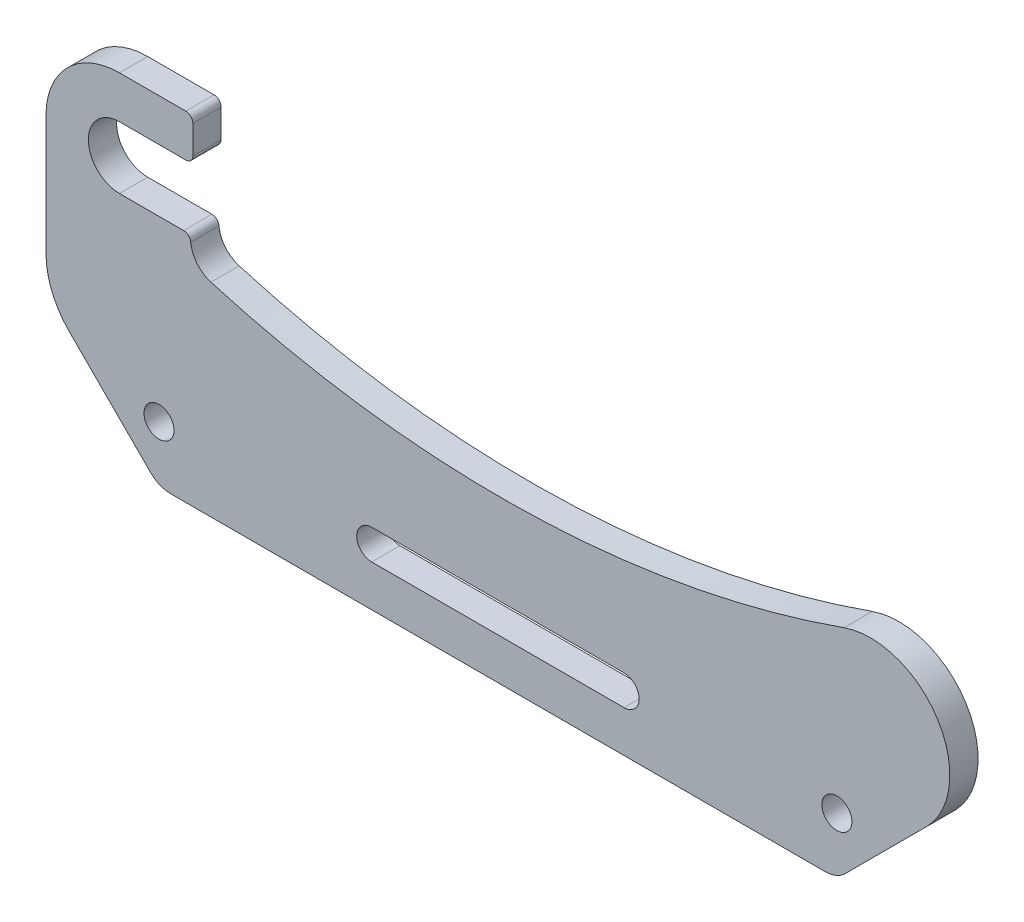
ISO-10303-21;
HEADER;
FILE_DESCRIPTION(('STEP AP214'),'2;1');
FILE_NAME('part.step','',(''),(''),'','','');
FILE_SCHEMA(('AUTOMOTIVE_DESIGN { 1 0 10303 214 1 1 1 1 }'));
ENDSEC;
DATA;
#1=APPLICATION_CONTEXT('core data for automotive mechanical design processes');
#2=APPLICATION_PROTOCOL_DEFINITION('international standard','automotive_design',2000,#1);
#3=PRODUCT_CONTEXT('',#1,'mechanical');
#4=PRODUCT('Part','Part','',(#3));
#5=PRODUCT_RELATED_PRODUCT_CATEGORY('part','',(#4));
#6=PRODUCT_DEFINITION_FORMATION('','',#4);
#7=PRODUCT_DEFINITION_CONTEXT('part definition',#1,'design');
#8=PRODUCT_DEFINITION('design','',#6,#7);
#9=PRODUCT_DEFINITION_SHAPE('','',#8);
#10=(LENGTH_UNIT() NAMED_UNIT(*) SI_UNIT(.MILLI.,.METRE.));
#11=(NAMED_UNIT(*) PLANE_ANGLE_UNIT() SI_UNIT($,.RADIAN.));
#12=(NAMED_UNIT(*) SI_UNIT($,.STERADIAN.) SOLID_ANGLE_UNIT());
#13=UNCERTAINTY_MEASURE_WITH_UNIT(LENGTH_MEASURE(1.E-05),#10,'distance_accuracy_value','');
#14=(GEOMETRIC_REPRESENTATION_CONTEXT(3) GLOBAL_UNCERTAINTY_ASSIGNED_CONTEXT((#13)) GLOBAL_UNIT_ASSIGNED_CONTEXT((#10,
#11,#12)) REPRESENTATION_CONTEXT('',''));
#15=CARTESIAN_POINT('',(0.,0.,0.));
#16=DIRECTION('',(0.,0.,1.));
#17=DIRECTION('',(1.,0.,0.));
#18=AXIS2_PLACEMENT_3D('',#15,#16,#17);
#19=CARTESIAN_POINT('',(161.29,-59.69,0.));
#20=DIRECTION('',(-0.707106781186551,0.707106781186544,0.));
#21=DIRECTION('',(-0.707106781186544,-0.707106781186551,0.));
#22=AXIS2_PLACEMENT_3D('',#19,#20,#21);
#23=PLANE('',#22);
#24=DIRECTION('',(-0.707106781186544,-0.707106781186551,0.));
#25=VECTOR('',#24,1.);
#26=CARTESIAN_POINT('',(161.29,-59.69,6.35));
#27=LINE('',#26,#25);
#28=CARTESIAN_POINT('',(181.464198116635,-39.5158018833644,6.35));
#29=VERTEX_POINT('',#28);
#30=CARTESIAN_POINT('',(163.149871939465,-57.8301280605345,6.35));
#31=VERTEX_POINT('',#30);
#32=EDGE_CURVE('E312',#29,#31,#27,.T.);
#33=ORIENTED_EDGE('',*,*,#32,.T.);
#34=DIRECTION('',(0.,0.,1.));
#35=VECTOR('',#34,1.);
#36=CARTESIAN_POINT('',(163.149871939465,-57.8301280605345,0.));
#37=LINE('',#36,#35);
#38=CARTESIAN_POINT('',(163.149871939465,-57.8301280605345,0.));
#39=VERTEX_POINT('',#38);
#40=EDGE_CURVE('E415',#31,#39,#37,.F.);
#41=ORIENTED_EDGE('',*,*,#40,.T.);
#42=DIRECTION('',(-0.707106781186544,-0.707106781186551,0.));
#43=VECTOR('',#42,1.);
#44=CARTESIAN_POINT('',(161.29,-59.69,0.));
#45=LINE('',#44,#43);
#46=CARTESIAN_POINT('',(181.464198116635,-39.5158018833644,0.));
#47=VERTEX_POINT('',#46);
#48=EDGE_CURVE('E315',#47,#39,#45,.T.);
#49=ORIENTED_EDGE('',*,*,#48,.F.);
#50=DIRECTION('',(0.,0.,1.));
#51=VECTOR('',#50,1.);
#52=CARTESIAN_POINT('',(181.464198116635,-39.5158018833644,0.));
#53=LINE('',#52,#51);
#54=EDGE_CURVE('E309',#47,#29,#53,.T.);
#55=ORIENTED_EDGE('',*,*,#54,.T.);
#56=EDGE_LOOP('',(#33,#41,#49,#55));
#57=FACE_BOUND('',#56,.T.);
#58=ADVANCED_FACE('F110',(#57),#23,.F.);
#59=CARTESIAN_POINT('',(0.,-6.985,6.35));
#60=DIRECTION('',(0.,-1.,0.));
#61=DIRECTION('',(1.,0.,0.));
#62=AXIS2_PLACEMENT_3D('',#59,#60,#61);
#63=PLANE('',#62);
#64=DIRECTION('',(-1.,0.,0.));
#65=VECTOR('',#64,1.);
#66=CARTESIAN_POINT('',(186.69,-6.985,6.35));
#67=LINE('',#66,#65);
#68=CARTESIAN_POINT('',(14.4456506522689,-6.985,6.35));
#69=VERTEX_POINT('',#68);
#70=CARTESIAN_POINT('',(0.,-6.985,6.35));
#71=VERTEX_POINT('',#70);
#72=EDGE_CURVE('E360',#69,#71,#67,.T.);
#73=ORIENTED_EDGE('',*,*,#72,.F.);
#74=DIRECTION('',(0.,0.,1.));
#75=VECTOR('',#74,1.);
#76=CARTESIAN_POINT('',(14.4456506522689,-6.985,6.35));
#77=LINE('',#76,#75);
#78=CARTESIAN_POINT('',(14.4456506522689,-6.985,0.));
#79=VERTEX_POINT('',#78);
#80=EDGE_CURVE('E118',#69,#79,#77,.F.);
#81=ORIENTED_EDGE('',*,*,#80,.T.);
#82=DIRECTION('',(-1.,0.,0.));
#83=VECTOR('',#82,1.);
#84=CARTESIAN_POINT('',(0.,-6.985,0.));
#85=LINE('',#84,#83);
#86=CARTESIAN_POINT('',(0.,-6.985,0.));
#87=VERTEX_POINT('',#86);
#88=EDGE_CURVE('E345',#79,#87,#85,.T.);
#89=ORIENTED_EDGE('',*,*,#88,.T.);
#90=DIRECTION('',(0.,0.,-1.));
#91=VECTOR('',#90,1.);
#92=CARTESIAN_POINT('',(0.,-6.985,6.35));
#93=LINE('',#92,#91);
#94=EDGE_CURVE('E362',#71,#87,#93,.T.);
#95=ORIENTED_EDGE('',*,*,#94,.F.);
#96=EDGE_LOOP('',(#73,#81,#89,#95));
#97=FACE_BOUND('',#96,.T.);
#98=ADVANCED_FACE('F452',(#97),#63,.F.);
#99=CARTESIAN_POINT('',(0.,0.,6.35));
#100=DIRECTION('',(0.,0.,1.));
#101=DIRECTION('',(1.,0.,0.));
#102=AXIS2_PLACEMENT_3D('',#99,#100,#101);
#103=PLANE('',#102);
#104=CARTESIAN_POINT('',(113.4618,-46.99,6.35));
#105=DIRECTION('',(0.,0.,1.));
#106=DIRECTION('',(1.,0.,0.));
#107=AXIS2_PLACEMENT_3D('',#104,#105,#106);
#108=CIRCLE('',#107,3.37819999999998);
#109=CARTESIAN_POINT('',(113.4618,-50.3682,6.35));
#110=VERTEX_POINT('',#109);
#111=CARTESIAN_POINT('',(113.4618,-43.6118,6.35));
#112=VERTEX_POINT('',#111);
#113=EDGE_CURVE('E295',#110,#112,#108,.T.);
#114=ORIENTED_EDGE('',*,*,#113,.F.);
#115=DIRECTION('',(1.,0.,0.));
#116=VECTOR('',#115,1.);
#117=CARTESIAN_POINT('',(56.7182,-50.3682,6.35));
#118=LINE('',#117,#116);
#119=CARTESIAN_POINT('',(56.7182,-50.3682,6.35));
#120=VERTEX_POINT('',#119);
#121=EDGE_CURVE('E275',#120,#110,#118,.T.);
#122=ORIENTED_EDGE('',*,*,#121,.F.);
#123=CARTESIAN_POINT('',(56.7182,-46.99,6.35));
#124=DIRECTION('',(0.,0.,1.));
#125=DIRECTION('',(1.,0.,0.));
#126=AXIS2_PLACEMENT_3D('',#123,#124,#125);
#127=CIRCLE('',#126,3.37819999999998);
#128=CARTESIAN_POINT('',(56.7182,-43.6118,6.35));
#129=VERTEX_POINT('',#128);
#130=EDGE_CURVE('E282',#129,#120,#127,.T.);
#131=ORIENTED_EDGE('',*,*,#130,.F.);
#132=DIRECTION('',(1.,0.,0.));
#133=VECTOR('',#132,1.);
#134=CARTESIAN_POINT('',(56.7182,-43.6118,6.35));
#135=LINE('',#134,#133);
#136=EDGE_CURVE('E290',#129,#112,#135,.T.);
#137=ORIENTED_EDGE('',*,*,#136,.T.);
#138=EDGE_LOOP('',(#114,#122,#131,#137));
#139=FACE_BOUND('',#138,.T.);
#140=DIRECTION('',(0.,1.,0.));
#141=VECTOR('',#140,1.);
#142=CARTESIAN_POINT('',(16.51,6.985,6.35));
#143=LINE('',#142,#141);
#144=CARTESIAN_POINT('',(16.51,8.5725,6.35));
#145=VERTEX_POINT('',#144);
#146=CARTESIAN_POINT('',(16.51,14.9225,6.35));
#147=VERTEX_POINT('',#146);
#148=EDGE_CURVE('E347',#145,#147,#143,.T.);
#149=ORIENTED_EDGE('',*,*,#148,.T.);
#150=CARTESIAN_POINT('',(14.9225,14.9225,6.35));
#151=DIRECTION('',(0.,0.,1.));
#152=DIRECTION('',(1.,0.,0.));
#153=AXIS2_PLACEMENT_3D('',#150,#151,#152);
#154=CIRCLE('',#153,1.5875);
#155=CARTESIAN_POINT('',(14.9225,16.51,6.35));
#156=VERTEX_POINT('',#155);
#157=EDGE_CURVE('E445',#147,#156,#154,.T.);
#158=ORIENTED_EDGE('',*,*,#157,.T.);
#159=DIRECTION('',(-1.,0.,0.));
#160=VECTOR('',#159,1.);
#161=CARTESIAN_POINT('',(16.51,16.51,6.35));
#162=LINE('',#161,#160);
#163=CARTESIAN_POINT('',(0.,16.51,6.35));
#164=VERTEX_POINT('',#163);
#165=EDGE_CURVE('E350',#156,#164,#162,.T.);
#166=ORIENTED_EDGE('',*,*,#165,.T.);
#167=CARTESIAN_POINT('',(0.,0.,6.35));
#168=DIRECTION('',(0.,0.,1.));
#169=DIRECTION('',(1.,0.,0.));
#170=AXIS2_PLACEMENT_3D('',#167,#168,#169);
#171=CIRCLE('',#170,16.51);
#172=CARTESIAN_POINT('',(-16.51,-1.152887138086E-13,6.35));
#173=VERTEX_POINT('',#172);
#174=EDGE_CURVE('E352',#164,#173,#171,.T.);
#175=ORIENTED_EDGE('',*,*,#174,.T.);
#176=DIRECTION('',(0.,-1.,0.));
#177=VECTOR('',#176,1.);
#178=CARTESIAN_POINT('',(-16.51,-1.152887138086E-13,6.35));
#179=LINE('',#178,#177);
#180=CARTESIAN_POINT('',(-16.51,-26.8996000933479,6.35));
#181=VERTEX_POINT('',#180);
#182=EDGE_CURVE('E354',#173,#181,#179,.T.);
#183=ORIENTED_EDGE('',*,*,#182,.T.);
#184=CARTESIAN_POINT('',(1.332003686,-26.8996000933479,6.35));
#185=DIRECTION('',(0.,0.,1.));
#186=DIRECTION('',(1.,0.,0.));
#187=AXIS2_PLACEMENT_3D('',#184,#185,#186);
#188=CIRCLE('',#187,17.842003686);
#189=CARTESIAN_POINT('',(-11.284198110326,-39.5158018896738,6.35));
#190=VERTEX_POINT('',#189);
#191=EDGE_CURVE('E395',#181,#190,#188,.T.);
#192=ORIENTED_EDGE('',*,*,#191,.T.);
#193=DIRECTION('',(-0.707106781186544,0.707106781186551,0.));
#194=VECTOR('',#193,1.);
#195=CARTESIAN_POINT('',(8.89,-59.69,6.35));
#196=LINE('',#195,#194);
#197=CARTESIAN_POINT('',(7.03012806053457,-57.8301280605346,6.35));
#198=VERTEX_POINT('',#197);
#199=EDGE_CURVE('E318',#198,#190,#196,.T.);
#200=ORIENTED_EDGE('',*,*,#199,.F.);
#201=CARTESIAN_POINT('',(11.5202561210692,-53.34,6.35));
#202=DIRECTION('',(0.,0.,1.));
#203=DIRECTION('',(1.,0.,0.));
#204=AXIS2_PLACEMENT_3D('',#201,#202,#203);
#205=CIRCLE('',#204,6.35);
#206=CARTESIAN_POINT('',(11.5202561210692,-59.69,6.35));
#207=VERTEX_POINT('',#206);
#208=EDGE_CURVE('E411',#198,#207,#205,.T.);
#209=ORIENTED_EDGE('',*,*,#208,.T.);
#210=DIRECTION('',(1.,0.,0.));
#211=VECTOR('',#210,1.);
#212=CARTESIAN_POINT('',(-16.51,-59.69,6.35));
#213=LINE('',#212,#211);
#214=CARTESIAN_POINT('',(158.659743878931,-59.69,6.35));
#215=VERTEX_POINT('',#214);
#216=EDGE_CURVE('E357',#207,#215,#213,.T.);
#217=ORIENTED_EDGE('',*,*,#216,.T.);
#218=CARTESIAN_POINT('',(158.659743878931,-53.34,6.35));
#219=DIRECTION('',(0.,0.,1.));
#220=DIRECTION('',(1.,0.,0.));
#221=AXIS2_PLACEMENT_3D('',#218,#219,#220);
#222=CIRCLE('',#221,6.35);
#223=EDGE_CURVE('E413',#215,#31,#222,.T.);
#224=ORIENTED_EDGE('',*,*,#223,.T.);
#225=ORIENTED_EDGE('',*,*,#32,.F.);
#226=CARTESIAN_POINT('',(168.847996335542,-26.8996001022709,6.35));
#227=DIRECTION('',(0.,0.,-1.));
#228=DIRECTION('',(1.,0.,0.));
#229=AXIS2_PLACEMENT_3D('',#226,#227,#228);
#230=CIRCLE('',#229,17.8420036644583);
#231=CARTESIAN_POINT('',(162.897569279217,-10.0790914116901,6.35));
#232=VERTEX_POINT('',#231);
#233=EDGE_CURVE('E303',#232,#29,#230,.T.);
#234=ORIENTED_EDGE('',*,*,#233,.F.);
#235=CARTESIAN_POINT('',(85.725,208.07027164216,6.35));
#236=DIRECTION('',(0.,0.,1.));
#237=DIRECTION('',(1.,0.,0.));
#238=AXIS2_PLACEMENT_3D('',#235,#236,#237);
#239=CIRCLE('',#238,231.397385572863);
#240=CARTESIAN_POINT('',(20.563849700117,-13.9630018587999,6.35));
#241=VERTEX_POINT('',#240);
#242=EDGE_CURVE('E336',#241,#232,#239,.T.);
#243=ORIENTED_EDGE('',*,*,#242,.F.);
#244=CARTESIAN_POINT('',(22.352,-7.86997153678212,6.35));
#245=DIRECTION('',(0.,0.,1.));
#246=DIRECTION('',(1.,0.,0.));
#247=AXIS2_PLACEMENT_3D('',#244,#245,#246);
#248=CIRCLE('',#247,6.35);
#249=CARTESIAN_POINT('',(16.0269205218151,-8.43199430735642,6.35));
#250=VERTEX_POINT('',#249);
#251=EDGE_CURVE('E424',#241,#250,#248,.F.);
#252=ORIENTED_EDGE('',*,*,#251,.T.);
#253=CARTESIAN_POINT('',(14.4456506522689,-8.5725,6.35));
#254=DIRECTION('',(0.,0.,1.));
#255=DIRECTION('',(1.,0.,0.));
#256=AXIS2_PLACEMENT_3D('',#253,#254,#255);
#257=CIRCLE('',#256,1.5875);
#258=EDGE_CURVE('E131',#250,#69,#257,.T.);
#259=ORIENTED_EDGE('',*,*,#258,.T.);
#260=ORIENTED_EDGE('',*,*,#72,.T.);
#261=CARTESIAN_POINT('',(0.,0.,6.35));
#262=DIRECTION('',(0.,0.,-1.));
#263=DIRECTION('',(1.,0.,0.));
#264=AXIS2_PLACEMENT_3D('',#261,#262,#263);
#265=CIRCLE('',#264,6.985);
#266=CARTESIAN_POINT('',(0.,6.985,6.35));
#267=VERTEX_POINT('',#266);
#268=EDGE_CURVE('E341',#71,#267,#265,.T.);
#269=ORIENTED_EDGE('',*,*,#268,.T.);
#270=DIRECTION('',(1.,0.,0.));
#271=VECTOR('',#270,1.);
#272=CARTESIAN_POINT('',(0.,6.985,6.35));
#273=LINE('',#272,#271);
#274=CARTESIAN_POINT('',(14.9225,6.985,6.35));
#275=VERTEX_POINT('',#274);
#276=EDGE_CURVE('E344',#267,#275,#273,.T.);
#277=ORIENTED_EDGE('',*,*,#276,.T.);
#278=CARTESIAN_POINT('',(14.9225,8.5725,6.35));
#279=DIRECTION('',(0.,0.,1.));
#280=DIRECTION('',(1.,0.,0.));
#281=AXIS2_PLACEMENT_3D('',#278,#279,#280);
#282=CIRCLE('',#281,1.5875);
#283=EDGE_CURVE('E442',#275,#145,#282,.T.);
#284=ORIENTED_EDGE('',*,*,#283,.T.);
#285=EDGE_LOOP('',(#149,#158,#166,#175,#183,#192,#200,#209,#217,#224,#225,#234,#243,#252,#259,
#260,#269,#277,#284));
#286=FACE_BOUND('',#285,.T.);
#287=CARTESIAN_POINT('',(8.89,-46.99,6.35));
#288=DIRECTION('',(0.,0.,1.));
#289=DIRECTION('',(1.,0.,0.));
#290=AXIS2_PLACEMENT_3D('',#287,#288,#289);
#291=CIRCLE('',#290,3.3782);
#292=CARTESIAN_POINT('',(12.2682,-46.99,6.35));
#293=VERTEX_POINT('',#292);
#294=EDGE_CURVE('E323',#293,#293,#291,.T.);
#295=ORIENTED_EDGE('',*,*,#294,.F.);
#296=EDGE_LOOP('',(#295));
#297=FACE_BOUND('',#296,.T.);
#298=CARTESIAN_POINT('',(161.29,-46.99,6.35));
#299=DIRECTION('',(0.,0.,1.));
#300=DIRECTION('',(1.,0.,0.));
#301=AXIS2_PLACEMENT_3D('',#298,#299,#300);
#302=CIRCLE('',#301,3.3782);
#303=CARTESIAN_POINT('',(164.6682,-46.99,6.35));
#304=VERTEX_POINT('',#303);
#305=EDGE_CURVE('E330',#304,#304,#302,.T.);
#306=ORIENTED_EDGE('',*,*,#305,.F.);
#307=EDGE_LOOP('',(#306));
#308=FACE_BOUND('',#307,.T.);
#309=ADVANCED_FACE('F466',(#139,#286,#297,#308),#103,.T.);
#310=CARTESIAN_POINT('',(0.,0.,0.));
#311=DIRECTION('',(0.,0.,1.));
#312=DIRECTION('',(1.,0.,0.));
#313=AXIS2_PLACEMENT_3D('',#310,#311,#312);
#314=PLANE('',#313);
#315=DIRECTION('',(1.,0.,0.));
#316=VECTOR('',#315,1.);
#317=CARTESIAN_POINT('',(56.7182,-50.3682,0.));
#318=LINE('',#317,#316);
#319=CARTESIAN_POINT('',(56.7182,-50.3682,0.));
#320=VERTEX_POINT('',#319);
#321=CARTESIAN_POINT('',(113.4618,-50.3682,0.));
#322=VERTEX_POINT('',#321);
#323=EDGE_CURVE('E264',#320,#322,#318,.T.);
#324=ORIENTED_EDGE('',*,*,#323,.T.);
#325=CARTESIAN_POINT('',(113.4618,-46.99,0.));
#326=DIRECTION('',(0.,0.,1.));
#327=DIRECTION('',(1.,0.,0.));
#328=AXIS2_PLACEMENT_3D('',#325,#326,#327);
#329=CIRCLE('',#328,3.3782);
#330=CARTESIAN_POINT('',(113.4618,-43.6118,0.));
#331=VERTEX_POINT('',#330);
#332=EDGE_CURVE('E298',#322,#331,#329,.T.);
#333=ORIENTED_EDGE('',*,*,#332,.T.);
#334=DIRECTION('',(1.,0.,0.));
#335=VECTOR('',#334,1.);
#336=CARTESIAN_POINT('',(56.7182,-43.6118,0.));
#337=LINE('',#336,#335);
#338=CARTESIAN_POINT('',(56.7182,-43.6118,0.));
#339=VERTEX_POINT('',#338);
#340=EDGE_CURVE('E274',#339,#331,#337,.T.);
#341=ORIENTED_EDGE('',*,*,#340,.F.);
#342=CARTESIAN_POINT('',(56.7182,-46.99,0.));
#343=DIRECTION('',(0.,0.,1.));
#344=DIRECTION('',(1.,0.,0.));
#345=AXIS2_PLACEMENT_3D('',#342,#343,#344);
#346=CIRCLE('',#345,3.3782);
#347=EDGE_CURVE('E279',#339,#320,#346,.T.);
#348=ORIENTED_EDGE('',*,*,#347,.T.);
#349=EDGE_LOOP('',(#324,#333,#341,#348));
#350=FACE_BOUND('',#349,.T.);
#351=CARTESIAN_POINT('',(8.89,-46.99,0.));
#352=DIRECTION('',(0.,0.,1.));
#353=DIRECTION('',(1.,0.,0.));
#354=AXIS2_PLACEMENT_3D('',#351,#352,#353);
#355=CIRCLE('',#354,3.3782);
#356=CARTESIAN_POINT('',(12.2682,-46.99,0.));
#357=VERTEX_POINT('',#356);
#358=EDGE_CURVE('E327',#357,#357,#355,.T.);
#359=ORIENTED_EDGE('',*,*,#358,.T.);
#360=EDGE_LOOP('',(#359));
#361=FACE_BOUND('',#360,.T.);
#362=CARTESIAN_POINT('',(161.29,-46.99,0.));
#363=DIRECTION('',(0.,0.,1.));
#364=DIRECTION('',(1.,0.,0.));
#365=AXIS2_PLACEMENT_3D('',#362,#363,#364);
#366=CIRCLE('',#365,3.3782);
#367=CARTESIAN_POINT('',(164.6682,-46.99,0.));
#368=VERTEX_POINT('',#367);
#369=EDGE_CURVE('E333',#368,#368,#366,.T.);
#370=ORIENTED_EDGE('',*,*,#369,.T.);
#371=EDGE_LOOP('',(#370));
#372=FACE_BOUND('',#371,.T.);
#373=DIRECTION('',(-1.,0.,0.));
#374=VECTOR('',#373,1.);
#375=CARTESIAN_POINT('',(16.51,16.51,0.));
#376=LINE('',#375,#374);
#377=CARTESIAN_POINT('',(14.9225,16.51,0.));
#378=VERTEX_POINT('',#377);
#379=CARTESIAN_POINT('',(0.,16.51,0.));
#380=VERTEX_POINT('',#379);
#381=EDGE_CURVE('E370',#378,#380,#376,.T.);
#382=ORIENTED_EDGE('',*,*,#381,.F.);
#383=CARTESIAN_POINT('',(14.9225,14.9225,0.));
#384=DIRECTION('',(0.,0.,1.));
#385=DIRECTION('',(1.,0.,0.));
#386=AXIS2_PLACEMENT_3D('',#383,#384,#385);
#387=CIRCLE('',#386,1.5875);
#388=CARTESIAN_POINT('',(16.51,14.9225,0.));
#389=VERTEX_POINT('',#388);
#390=EDGE_CURVE('E435',#378,#389,#387,.F.);
#391=ORIENTED_EDGE('',*,*,#390,.T.);
#392=DIRECTION('',(0.,1.,0.));
#393=VECTOR('',#392,1.);
#394=CARTESIAN_POINT('',(16.51,6.985,0.));
#395=LINE('',#394,#393);
#396=CARTESIAN_POINT('',(16.51,8.5725,0.));
#397=VERTEX_POINT('',#396);
#398=EDGE_CURVE('E367',#397,#389,#395,.T.);
#399=ORIENTED_EDGE('',*,*,#398,.F.);
#400=CARTESIAN_POINT('',(14.9225,8.5725,0.));
#401=DIRECTION('',(0.,0.,1.));
#402=DIRECTION('',(1.,0.,0.));
#403=AXIS2_PLACEMENT_3D('',#400,#401,#402);
#404=CIRCLE('',#403,1.5875);
#405=CARTESIAN_POINT('',(14.9225,6.985,0.));
#406=VERTEX_POINT('',#405);
#407=EDGE_CURVE('E431',#397,#406,#404,.F.);
#408=ORIENTED_EDGE('',*,*,#407,.T.);
#409=DIRECTION('',(1.,0.,0.));
#410=VECTOR('',#409,1.);
#411=CARTESIAN_POINT('',(0.,6.985,0.));
#412=LINE('',#411,#410);
#413=CARTESIAN_POINT('',(0.,6.985,0.));
#414=VERTEX_POINT('',#413);
#415=EDGE_CURVE('E365',#414,#406,#412,.T.);
#416=ORIENTED_EDGE('',*,*,#415,.F.);
#417=CARTESIAN_POINT('',(0.,0.,0.));
#418=DIRECTION('',(0.,0.,-1.));
#419=DIRECTION('',(1.,0.,0.));
#420=AXIS2_PLACEMENT_3D('',#417,#418,#419);
#421=CIRCLE('',#420,6.985);
#422=EDGE_CURVE('E339',#87,#414,#421,.T.);
#423=ORIENTED_EDGE('',*,*,#422,.F.);
#424=ORIENTED_EDGE('',*,*,#88,.F.);
#425=CARTESIAN_POINT('',(14.4456506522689,-8.5725,0.));
#426=DIRECTION('',(0.,0.,1.));
#427=DIRECTION('',(1.,0.,0.));
#428=AXIS2_PLACEMENT_3D('',#425,#426,#427);
#429=CIRCLE('',#428,1.5875);
#430=CARTESIAN_POINT('',(16.0269205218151,-8.43199430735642,0.));
#431=VERTEX_POINT('',#430);
#432=EDGE_CURVE('E433',#79,#431,#429,.F.);
#433=ORIENTED_EDGE('',*,*,#432,.T.);
#434=CARTESIAN_POINT('',(22.352,-7.86997153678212,0.));
#435=DIRECTION('',(0.,0.,1.));
#436=DIRECTION('',(1.,0.,0.));
#437=AXIS2_PLACEMENT_3D('',#434,#435,#436);
#438=CIRCLE('',#437,6.35);
#439=CARTESIAN_POINT('',(20.563849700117,-13.9630018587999,0.));
#440=VERTEX_POINT('',#439);
#441=EDGE_CURVE('E426',#431,#440,#438,.T.);
#442=ORIENTED_EDGE('',*,*,#441,.T.);
#443=CARTESIAN_POINT('',(85.725,208.07027164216,0.));
#444=DIRECTION('',(0.,0.,1.));
#445=DIRECTION('',(1.,0.,0.));
#446=AXIS2_PLACEMENT_3D('',#443,#444,#445);
#447=CIRCLE('',#446,231.397385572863);
#448=CARTESIAN_POINT('',(162.897569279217,-10.0790914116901,0.));
#449=VERTEX_POINT('',#448);
#450=EDGE_CURVE('E337',#440,#449,#447,.T.);
#451=ORIENTED_EDGE('',*,*,#450,.T.);
#452=CARTESIAN_POINT('',(168.847996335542,-26.8996001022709,0.));
#453=DIRECTION('',(0.,0.,-1.));
#454=DIRECTION('',(1.,0.,0.));
#455=AXIS2_PLACEMENT_3D('',#452,#453,#454);
#456=CIRCLE('',#455,17.8420036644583);
#457=EDGE_CURVE('E304',#449,#47,#456,.T.);
#458=ORIENTED_EDGE('',*,*,#457,.T.);
#459=ORIENTED_EDGE('',*,*,#48,.T.);
#460=CARTESIAN_POINT('',(158.659743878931,-53.34,0.));
#461=DIRECTION('',(0.,0.,1.));
#462=DIRECTION('',(1.,0.,0.));
#463=AXIS2_PLACEMENT_3D('',#460,#461,#462);
#464=CIRCLE('',#463,6.35);
#465=CARTESIAN_POINT('',(158.659743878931,-59.69,0.));
#466=VERTEX_POINT('',#465);
#467=EDGE_CURVE('E419',#39,#466,#464,.F.);
#468=ORIENTED_EDGE('',*,*,#467,.T.);
#469=DIRECTION('',(1.,0.,0.));
#470=VECTOR('',#469,1.);
#471=CARTESIAN_POINT('',(16.51,-59.69,0.));
#472=LINE('',#471,#470);
#473=CARTESIAN_POINT('',(11.5202561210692,-59.69,0.));
#474=VERTEX_POINT('',#473);
#475=EDGE_CURVE('E377',#474,#466,#472,.T.);
#476=ORIENTED_EDGE('',*,*,#475,.F.);
#477=CARTESIAN_POINT('',(11.5202561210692,-53.34,0.));
#478=DIRECTION('',(0.,0.,1.));
#479=DIRECTION('',(1.,0.,0.));
#480=AXIS2_PLACEMENT_3D('',#477,#478,#479);
#481=CIRCLE('',#480,6.35);
#482=CARTESIAN_POINT('',(7.03012806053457,-57.8301280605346,0.));
#483=VERTEX_POINT('',#482);
#484=EDGE_CURVE('E417',#474,#483,#481,.F.);
#485=ORIENTED_EDGE('',*,*,#484,.T.);
#486=DIRECTION('',(-0.707106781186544,0.707106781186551,0.));
#487=VECTOR('',#486,1.);
#488=CARTESIAN_POINT('',(8.89,-59.69,0.));
#489=LINE('',#488,#487);
#490=CARTESIAN_POINT('',(-11.284198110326,-39.5158018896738,0.));
#491=VERTEX_POINT('',#490);
#492=EDGE_CURVE('E321',#483,#491,#489,.T.);
#493=ORIENTED_EDGE('',*,*,#492,.T.);
#494=CARTESIAN_POINT('',(1.332003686,-26.8996000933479,0.));
#495=DIRECTION('',(0.,0.,1.));
#496=DIRECTION('',(1.,0.,0.));
#497=AXIS2_PLACEMENT_3D('',#494,#495,#496);
#498=CIRCLE('',#497,17.842003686);
#499=CARTESIAN_POINT('',(-16.51,-26.8996000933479,0.));
#500=VERTEX_POINT('',#499);
#501=EDGE_CURVE('E401',#491,#500,#498,.F.);
#502=ORIENTED_EDGE('',*,*,#501,.T.);
#503=DIRECTION('',(0.,-1.,0.));
#504=VECTOR('',#503,1.);
#505=CARTESIAN_POINT('',(-16.51,-1.152887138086E-13,0.));
#506=LINE('',#505,#504);
#507=CARTESIAN_POINT('',(-16.51,-1.152887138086E-13,0.));
#508=VERTEX_POINT('',#507);
#509=EDGE_CURVE('E374',#508,#500,#506,.T.);
#510=ORIENTED_EDGE('',*,*,#509,.F.);
#511=CARTESIAN_POINT('',(0.,0.,0.));
#512=DIRECTION('',(0.,0.,1.));
#513=DIRECTION('',(1.,0.,0.));
#514=AXIS2_PLACEMENT_3D('',#511,#512,#513);
#515=CIRCLE('',#514,16.51);
#516=EDGE_CURVE('E372',#380,#508,#515,.T.);
#517=ORIENTED_EDGE('',*,*,#516,.F.);
#518=EDGE_LOOP('',(#382,#391,#399,#408,#416,#423,#424,#433,#442,#451,#458,#459,#468,#476,#485,
#493,#502,#510,#517));
#519=FACE_BOUND('',#518,.T.);
#520=ADVANCED_FACE('F287',(#350,#361,#372,#519),#314,.F.);
#521=CARTESIAN_POINT('',(0.,0.,6.35));
#522=DIRECTION('',(0.,0.,-1.));
#523=DIRECTION('',(-1.,0.,0.));
#524=AXIS2_PLACEMENT_3D('',#521,#522,#523);
#525=CYLINDRICAL_SURFACE('',#524,6.985);
#526=ORIENTED_EDGE('',*,*,#422,.T.);
#527=DIRECTION('',(0.,0.,-1.));
#528=VECTOR('',#527,1.);
#529=CARTESIAN_POINT('',(0.,6.985,6.35));
#530=LINE('',#529,#528);
#531=EDGE_CURVE('E389',#267,#414,#530,.T.);
#532=ORIENTED_EDGE('',*,*,#531,.F.);
#533=ORIENTED_EDGE('',*,*,#268,.F.);
#534=ORIENTED_EDGE('',*,*,#94,.T.);
#535=EDGE_LOOP('',(#526,#532,#533,#534));
#536=FACE_BOUND('',#535,.T.);
#537=ADVANCED_FACE('F531',(#536),#525,.F.);
#538=CARTESIAN_POINT('',(0.,6.985,6.35));
#539=DIRECTION('',(0.,1.,0.));
#540=DIRECTION('',(0.,0.,1.));
#541=AXIS2_PLACEMENT_3D('',#538,#539,#540);
#542=PLANE('',#541);
#543=ORIENTED_EDGE('',*,*,#415,.T.);
#544=DIRECTION('',(0.,0.,-1.));
#545=VECTOR('',#544,1.);
#546=CARTESIAN_POINT('',(14.9225,6.985,6.35));
#547=LINE('',#546,#545);
#548=EDGE_CURVE('E13',#406,#275,#547,.F.);
#549=ORIENTED_EDGE('',*,*,#548,.T.);
#550=ORIENTED_EDGE('',*,*,#276,.F.);
#551=ORIENTED_EDGE('',*,*,#531,.T.);
#552=EDGE_LOOP('',(#543,#549,#550,#551));
#553=FACE_BOUND('',#552,.T.);
#554=ADVANCED_FACE('F527',(#553),#542,.F.);
#555=CARTESIAN_POINT('',(16.51,6.985,6.35));
#556=DIRECTION('',(-1.,0.,0.));
#557=DIRECTION('',(0.,0.,1.));
#558=AXIS2_PLACEMENT_3D('',#555,#556,#557);
#559=PLANE('',#558);
#560=ORIENTED_EDGE('',*,*,#398,.T.);
#561=DIRECTION('',(0.,0.,-1.));
#562=VECTOR('',#561,1.);
#563=CARTESIAN_POINT('',(16.51,14.9225,6.35));
#564=LINE('',#563,#562);
#565=EDGE_CURVE('E440',#389,#147,#564,.F.);
#566=ORIENTED_EDGE('',*,*,#565,.T.);
#567=ORIENTED_EDGE('',*,*,#148,.F.);
#568=DIRECTION('',(0.,0.,-1.));
#569=VECTOR('',#568,1.);
#570=CARTESIAN_POINT('',(16.51,8.5725,6.35));
#571=LINE('',#570,#569);
#572=EDGE_CURVE('E437',#145,#397,#571,.T.);
#573=ORIENTED_EDGE('',*,*,#572,.T.);
#574=EDGE_LOOP('',(#560,#566,#567,#573));
#575=FACE_BOUND('',#574,.T.);
#576=ADVANCED_FACE('F523',(#575),#559,.F.);
#577=CARTESIAN_POINT('',(16.51,16.51,6.35));
#578=DIRECTION('',(0.,-1.,0.));
#579=DIRECTION('',(0.,0.,-1.));
#580=AXIS2_PLACEMENT_3D('',#577,#578,#579);
#581=PLANE('',#580);
#582=ORIENTED_EDGE('',*,*,#165,.F.);
#583=DIRECTION('',(0.,0.,-1.));
#584=VECTOR('',#583,1.);
#585=CARTESIAN_POINT('',(14.9225,16.51,6.35));
#586=LINE('',#585,#584);
#587=EDGE_CURVE('E428',#156,#378,#586,.T.);
#588=ORIENTED_EDGE('',*,*,#587,.T.);
#589=ORIENTED_EDGE('',*,*,#381,.T.);
#590=DIRECTION('',(0.,0.,-1.));
#591=VECTOR('',#590,1.);
#592=CARTESIAN_POINT('',(0.,16.51,6.35));
#593=LINE('',#592,#591);
#594=EDGE_CURVE('E386',#164,#380,#593,.T.);
#595=ORIENTED_EDGE('',*,*,#594,.F.);
#596=EDGE_LOOP('',(#582,#588,#589,#595));
#597=FACE_BOUND('',#596,.T.);
#598=ADVANCED_FACE('F515',(#597),#581,.F.);
#599=CARTESIAN_POINT('',(0.,0.,6.35));
#600=DIRECTION('',(0.,0.,-1.));
#601=DIRECTION('',(-1.,0.,0.));
#602=AXIS2_PLACEMENT_3D('',#599,#600,#601);
#603=CYLINDRICAL_SURFACE('',#602,16.51);
#604=ORIENTED_EDGE('',*,*,#516,.T.);
#605=DIRECTION('',(0.,0.,-1.));
#606=VECTOR('',#605,1.);
#607=CARTESIAN_POINT('',(-16.51,-1.152887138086E-13,6.35));
#608=LINE('',#607,#606);
#609=EDGE_CURVE('E383',#173,#508,#608,.T.);
#610=ORIENTED_EDGE('',*,*,#609,.F.);
#611=ORIENTED_EDGE('',*,*,#174,.F.);
#612=ORIENTED_EDGE('',*,*,#594,.T.);
#613=EDGE_LOOP('',(#604,#610,#611,#612));
#614=FACE_BOUND('',#613,.T.);
#615=ADVANCED_FACE('F510',(#614),#603,.T.);
#616=CARTESIAN_POINT('',(-16.51,-1.152887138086E-13,6.35));
#617=DIRECTION('',(1.,0.,0.));
#618=DIRECTION('',(0.,1.,0.));
#619=AXIS2_PLACEMENT_3D('',#616,#617,#618);
#620=PLANE('',#619);
#621=ORIENTED_EDGE('',*,*,#509,.T.);
#622=DIRECTION('',(0.,0.,1.));
#623=VECTOR('',#622,1.);
#624=CARTESIAN_POINT('',(-16.51,-26.8996000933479,6.35));
#625=LINE('',#624,#623);
#626=EDGE_CURVE('E392',#500,#181,#625,.T.);
#627=ORIENTED_EDGE('',*,*,#626,.T.);
#628=ORIENTED_EDGE('',*,*,#182,.F.);
#629=ORIENTED_EDGE('',*,*,#609,.T.);
#630=EDGE_LOOP('',(#621,#627,#628,#629));
#631=FACE_BOUND('',#630,.T.);
#632=ADVANCED_FACE('F505',(#631),#620,.F.);
#633=CARTESIAN_POINT('',(16.51,-59.69,6.35));
#634=DIRECTION('',(0.,1.,0.));
#635=DIRECTION('',(0.,0.,1.));
#636=AXIS2_PLACEMENT_3D('',#633,#634,#635);
#637=PLANE('',#636);
#638=ORIENTED_EDGE('',*,*,#475,.T.);
#639=DIRECTION('',(0.,0.,1.));
#640=VECTOR('',#639,1.);
#641=CARTESIAN_POINT('',(158.659743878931,-59.69,6.35));
#642=LINE('',#641,#640);
#643=EDGE_CURVE('E408',#466,#215,#642,.T.);
#644=ORIENTED_EDGE('',*,*,#643,.T.);
#645=ORIENTED_EDGE('',*,*,#216,.F.);
#646=DIRECTION('',(0.,0.,1.));
#647=VECTOR('',#646,1.);
#648=CARTESIAN_POINT('',(11.5202561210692,-59.69,6.35));
#649=LINE('',#648,#647);
#650=EDGE_CURVE('E406',#207,#474,#649,.F.);
#651=ORIENTED_EDGE('',*,*,#650,.T.);
#652=EDGE_LOOP('',(#638,#644,#645,#651));
#653=FACE_BOUND('',#652,.T.);
#654=ADVANCED_FACE('F487',(#653),#637,.F.);
#655=CARTESIAN_POINT('',(85.725,208.07027164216,0.));
#656=DIRECTION('',(0.,0.,1.));
#657=DIRECTION('',(1.,0.,0.));
#658=AXIS2_PLACEMENT_3D('',#655,#656,#657);
#659=CYLINDRICAL_SURFACE('',#658,231.397385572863);
#660=ORIENTED_EDGE('',*,*,#450,.F.);
#661=DIRECTION('',(0.,0.,1.));
#662=VECTOR('',#661,1.);
#663=CARTESIAN_POINT('',(20.563849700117,-13.9630018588,0.));
#664=LINE('',#663,#662);
#665=EDGE_CURVE('E403',#440,#241,#664,.T.);
#666=ORIENTED_EDGE('',*,*,#665,.T.);
#667=ORIENTED_EDGE('',*,*,#242,.T.);
#668=DIRECTION('',(0.,0.,1.));
#669=VECTOR('',#668,1.);
#670=CARTESIAN_POINT('',(162.897569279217,-10.0790914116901,0.));
#671=LINE('',#670,#669);
#672=EDGE_CURVE('E307',#449,#232,#671,.T.);
#673=ORIENTED_EDGE('',*,*,#672,.F.);
#674=EDGE_LOOP('',(#660,#666,#667,#673));
#675=FACE_BOUND('',#674,.T.);
#676=ADVANCED_FACE('F473',(#675),#659,.F.);
#677=CARTESIAN_POINT('',(161.29,-46.99,6.35));
#678=DIRECTION('',(0.,0.,1.));
#679=DIRECTION('',(1.,0.,0.));
#680=AXIS2_PLACEMENT_3D('',#677,#678,#679);
#681=CYLINDRICAL_SURFACE('',#680,3.3782);
#682=ORIENTED_EDGE('',*,*,#369,.F.);
#683=EDGE_LOOP('',(#682));
#684=FACE_BOUND('',#683,.T.);
#685=ORIENTED_EDGE('',*,*,#305,.T.);
#686=EDGE_LOOP('',(#685));
#687=FACE_BOUND('',#686,.T.);
#688=ADVANCED_FACE('F555',(#684,#687),#681,.F.);
#689=CARTESIAN_POINT('',(8.89,-46.99,6.35));
#690=DIRECTION('',(0.,0.,1.));
#691=DIRECTION('',(1.,0.,0.));
#692=AXIS2_PLACEMENT_3D('',#689,#690,#691);
#693=CYLINDRICAL_SURFACE('',#692,3.3782);
#694=ORIENTED_EDGE('',*,*,#358,.F.);
#695=EDGE_LOOP('',(#694));
#696=FACE_BOUND('',#695,.T.);
#697=ORIENTED_EDGE('',*,*,#294,.T.);
#698=EDGE_LOOP('',(#697));
#699=FACE_BOUND('',#698,.T.);
#700=ADVANCED_FACE('F552',(#696,#699),#693,.F.);
#701=CARTESIAN_POINT('',(8.89,-59.69,0.));
#702=DIRECTION('',(0.707106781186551,0.707106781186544,0.));
#703=DIRECTION('',(-0.707106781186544,0.707106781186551,0.));
#704=AXIS2_PLACEMENT_3D('',#701,#702,#703);
#705=PLANE('',#704);
#706=ORIENTED_EDGE('',*,*,#492,.F.);
#707=DIRECTION('',(0.,0.,1.));
#708=VECTOR('',#707,1.);
#709=CARTESIAN_POINT('',(7.03012806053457,-57.8301280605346,0.));
#710=LINE('',#709,#708);
#711=EDGE_CURVE('E421',#483,#198,#710,.T.);
#712=ORIENTED_EDGE('',*,*,#711,.T.);
#713=ORIENTED_EDGE('',*,*,#199,.T.);
#714=DIRECTION('',(0.,0.,1.));
#715=VECTOR('',#714,1.);
#716=CARTESIAN_POINT('',(-11.284198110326,-39.5158018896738,0.));
#717=LINE('',#716,#715);
#718=EDGE_CURVE('E398',#190,#491,#717,.F.);
#719=ORIENTED_EDGE('',*,*,#718,.T.);
#720=EDGE_LOOP('',(#706,#712,#713,#719));
#721=FACE_BOUND('',#720,.T.);
#722=ADVANCED_FACE('F495',(#721),#705,.F.);
#723=CARTESIAN_POINT('',(168.847996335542,-26.8996001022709,0.));
#724=DIRECTION('',(0.,0.,1.));
#725=DIRECTION('',(1.,0.,0.));
#726=AXIS2_PLACEMENT_3D('',#723,#724,#725);
#727=CYLINDRICAL_SURFACE('',#726,17.8420036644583);
#728=ORIENTED_EDGE('',*,*,#233,.T.);
#729=ORIENTED_EDGE('',*,*,#54,.F.);
#730=ORIENTED_EDGE('',*,*,#457,.F.);
#731=ORIENTED_EDGE('',*,*,#672,.T.);
#732=EDGE_LOOP('',(#728,#729,#730,#731));
#733=FACE_BOUND('',#732,.T.);
#734=ADVANCED_FACE('F476',(#733),#727,.T.);
#735=CARTESIAN_POINT('',(113.4618,-46.99,6.35));
#736=DIRECTION('',(0.,0.,1.));
#737=DIRECTION('',(1.,0.,0.));
#738=AXIS2_PLACEMENT_3D('',#735,#736,#737);
#739=CYLINDRICAL_SURFACE('',#738,3.37819999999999);
#740=ORIENTED_EDGE('',*,*,#332,.F.);
#741=DIRECTION('',(0.,0.,1.));
#742=VECTOR('',#741,1.);
#743=CARTESIAN_POINT('',(113.4618,-50.3682,6.35));
#744=LINE('',#743,#742);
#745=EDGE_CURVE('E270',#110,#322,#744,.F.);
#746=ORIENTED_EDGE('',*,*,#745,.F.);
#747=ORIENTED_EDGE('',*,*,#113,.T.);
#748=DIRECTION('',(0.,0.,1.));
#749=VECTOR('',#748,1.);
#750=CARTESIAN_POINT('',(113.4618,-43.6118,6.35));
#751=LINE('',#750,#749);
#752=EDGE_CURVE('E300',#331,#112,#751,.T.);
#753=ORIENTED_EDGE('',*,*,#752,.F.);
#754=EDGE_LOOP('',(#740,#746,#747,#753));
#755=FACE_BOUND('',#754,.T.);
#756=ADVANCED_FACE('F620',(#755),#739,.F.);
#757=CARTESIAN_POINT('',(56.7182,-46.99,6.35));
#758=DIRECTION('',(0.,0.,1.));
#759=DIRECTION('',(1.,0.,0.));
#760=AXIS2_PLACEMENT_3D('',#757,#758,#759);
#761=CYLINDRICAL_SURFACE('',#760,3.37819999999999);
#762=ORIENTED_EDGE('',*,*,#130,.T.);
#763=DIRECTION('',(0.,0.,1.));
#764=VECTOR('',#763,1.);
#765=CARTESIAN_POINT('',(56.7182,-50.3682,6.35));
#766=LINE('',#765,#764);
#767=EDGE_CURVE('E267',#320,#120,#766,.T.);
#768=ORIENTED_EDGE('',*,*,#767,.F.);
#769=ORIENTED_EDGE('',*,*,#347,.F.);
#770=DIRECTION('',(0.,0.,1.));
#771=VECTOR('',#770,1.);
#772=CARTESIAN_POINT('',(56.7182,-43.6118,6.35));
#773=LINE('',#772,#771);
#774=EDGE_CURVE('E284',#129,#339,#773,.F.);
#775=ORIENTED_EDGE('',*,*,#774,.F.);
#776=EDGE_LOOP('',(#762,#768,#769,#775));
#777=FACE_BOUND('',#776,.T.);
#778=ADVANCED_FACE('F278',(#777),#761,.F.);
#779=CARTESIAN_POINT('',(56.7182,-43.6118,6.35));
#780=DIRECTION('',(0.,1.,0.));
#781=DIRECTION('',(0.,0.,1.));
#782=AXIS2_PLACEMENT_3D('',#779,#780,#781);
#783=PLANE('',#782);
#784=ORIENTED_EDGE('',*,*,#752,.T.);
#785=ORIENTED_EDGE('',*,*,#136,.F.);
#786=ORIENTED_EDGE('',*,*,#774,.T.);
#787=ORIENTED_EDGE('',*,*,#340,.T.);
#788=EDGE_LOOP('',(#784,#785,#786,#787));
#789=FACE_BOUND('',#788,.T.);
#790=ADVANCED_FACE('F632',(#789),#783,.F.);
#791=CARTESIAN_POINT('',(56.7182,-50.3682,6.35));
#792=DIRECTION('',(0.,-1.,0.));
#793=DIRECTION('',(0.,0.,-1.));
#794=AXIS2_PLACEMENT_3D('',#791,#792,#793);
#795=PLANE('',#794);
#796=ORIENTED_EDGE('',*,*,#745,.T.);
#797=ORIENTED_EDGE('',*,*,#323,.F.);
#798=ORIENTED_EDGE('',*,*,#767,.T.);
#799=ORIENTED_EDGE('',*,*,#121,.T.);
#800=EDGE_LOOP('',(#796,#797,#798,#799));
#801=FACE_BOUND('',#800,.T.);
#802=ADVANCED_FACE('F266',(#801),#795,.F.);
#803=CARTESIAN_POINT('',(1.332003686,-26.8996000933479,6.35));
#804=DIRECTION('',(0.,0.,1.));
#805=DIRECTION('',(1.,0.,0.));
#806=AXIS2_PLACEMENT_3D('',#803,#804,#805);
#807=CYLINDRICAL_SURFACE('',#806,17.842003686);
#808=ORIENTED_EDGE('',*,*,#501,.F.);
#809=ORIENTED_EDGE('',*,*,#718,.F.);
#810=ORIENTED_EDGE('',*,*,#191,.F.);
#811=ORIENTED_EDGE('',*,*,#626,.F.);
#812=EDGE_LOOP('',(#808,#809,#810,#811));
#813=FACE_BOUND('',#812,.T.);
#814=ADVANCED_FACE('F501',(#813),#807,.T.);
#815=CARTESIAN_POINT('',(22.352,-7.86997153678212,0.));
#816=DIRECTION('',(0.,0.,1.));
#817=DIRECTION('',(1.,0.,0.));
#818=AXIS2_PLACEMENT_3D('',#815,#816,#817);
#819=CYLINDRICAL_SURFACE('',#818,6.35);
#820=ORIENTED_EDGE('',*,*,#441,.F.);
#821=DIRECTION('',(0.,0.,1.));
#822=VECTOR('',#821,1.);
#823=CARTESIAN_POINT('',(16.0269205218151,-8.43199430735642,0.));
#824=LINE('',#823,#822);
#825=EDGE_CURVE('E447',#431,#250,#824,.T.);
#826=ORIENTED_EDGE('',*,*,#825,.T.);
#827=ORIENTED_EDGE('',*,*,#251,.F.);
#828=ORIENTED_EDGE('',*,*,#665,.F.);
#829=EDGE_LOOP('',(#820,#826,#827,#828));
#830=FACE_BOUND('',#829,.T.);
#831=ADVANCED_FACE('F463',(#830),#819,.F.);
#832=CARTESIAN_POINT('',(158.659743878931,-53.34,6.35));
#833=DIRECTION('',(0.,0.,1.));
#834=DIRECTION('',(1.,0.,0.));
#835=AXIS2_PLACEMENT_3D('',#832,#833,#834);
#836=CYLINDRICAL_SURFACE('',#835,6.35);
#837=ORIENTED_EDGE('',*,*,#467,.F.);
#838=ORIENTED_EDGE('',*,*,#40,.F.);
#839=ORIENTED_EDGE('',*,*,#223,.F.);
#840=ORIENTED_EDGE('',*,*,#643,.F.);
#841=EDGE_LOOP('',(#837,#838,#839,#840));
#842=FACE_BOUND('',#841,.T.);
#843=ADVANCED_FACE('F482',(#842),#836,.T.);
#844=CARTESIAN_POINT('',(11.5202561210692,-53.34,0.));
#845=DIRECTION('',(0.,0.,1.));
#846=DIRECTION('',(1.,0.,0.));
#847=AXIS2_PLACEMENT_3D('',#844,#845,#846);
#848=CYLINDRICAL_SURFACE('',#847,6.35);
#849=ORIENTED_EDGE('',*,*,#484,.F.);
#850=ORIENTED_EDGE('',*,*,#650,.F.);
#851=ORIENTED_EDGE('',*,*,#208,.F.);
#852=ORIENTED_EDGE('',*,*,#711,.F.);
#853=EDGE_LOOP('',(#849,#850,#851,#852));
#854=FACE_BOUND('',#853,.T.);
#855=ADVANCED_FACE('F491',(#854),#848,.T.);
#856=CARTESIAN_POINT('',(14.9225,14.9225,6.35));
#857=DIRECTION('',(0.,0.,-1.));
#858=DIRECTION('',(-1.,0.,0.));
#859=AXIS2_PLACEMENT_3D('',#856,#857,#858);
#860=CYLINDRICAL_SURFACE('',#859,1.5875);
#861=ORIENTED_EDGE('',*,*,#157,.F.);
#862=ORIENTED_EDGE('',*,*,#565,.F.);
#863=ORIENTED_EDGE('',*,*,#390,.F.);
#864=ORIENTED_EDGE('',*,*,#587,.F.);
#865=EDGE_LOOP('',(#861,#862,#863,#864));
#866=FACE_BOUND('',#865,.T.);
#867=ADVANCED_FACE('F519',(#866),#860,.T.);
#868=CARTESIAN_POINT('',(14.4456506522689,-8.5725,0.));
#869=DIRECTION('',(0.,0.,1.));
#870=DIRECTION('',(1.,0.,0.));
#871=AXIS2_PLACEMENT_3D('',#868,#869,#870);
#872=CYLINDRICAL_SURFACE('',#871,1.5875);
#873=ORIENTED_EDGE('',*,*,#432,.F.);
#874=ORIENTED_EDGE('',*,*,#80,.F.);
#875=ORIENTED_EDGE('',*,*,#258,.F.);
#876=ORIENTED_EDGE('',*,*,#825,.F.);
#877=EDGE_LOOP('',(#873,#874,#875,#876));
#878=FACE_BOUND('',#877,.T.);
#879=ADVANCED_FACE('F461',(#878),#872,.T.);
#880=CARTESIAN_POINT('',(14.9225,8.5725,6.35));
#881=DIRECTION('',(0.,0.,-1.));
#882=DIRECTION('',(-1.,0.,0.));
#883=AXIS2_PLACEMENT_3D('',#880,#881,#882);
#884=CYLINDRICAL_SURFACE('',#883,1.5875);
#885=ORIENTED_EDGE('',*,*,#283,.F.);
#886=ORIENTED_EDGE('',*,*,#548,.F.);
#887=ORIENTED_EDGE('',*,*,#407,.F.);
#888=ORIENTED_EDGE('',*,*,#572,.F.);
#889=EDGE_LOOP('',(#885,#886,#887,#888));
#890=FACE_BOUND('',#889,.T.);
#891=ADVANCED_FACE('F112',(#890),#884,.T.);
#892=CLOSED_SHELL('',(#58,#98,#309,#520,#537,#554,#576,#598,#615,#632,#654,#676,#688,#700,#722,
#734,#756,#778,#790,#802,#814,#831,#843,#855,#867,#879,#891));
#893=MANIFOLD_SOLID_BREP('B2',#892);
#894=ADVANCED_BREP_SHAPE_REPRESENTATION('',(#18,#893),#14);
#895=SHAPE_DEFINITION_REPRESENTATION(#9,#894);
ENDSEC;
END-ISO-10303-21;
